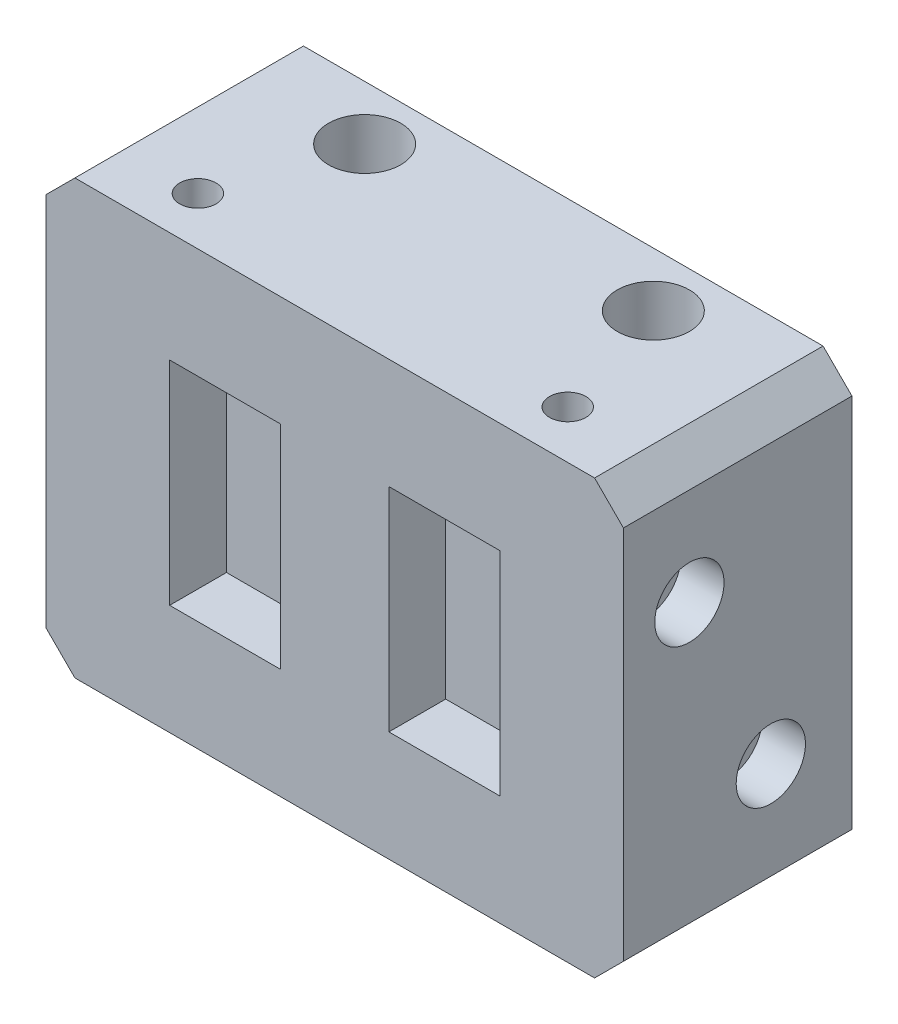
ISO-10303-21;
HEADER;
FILE_DESCRIPTION(('STEP AP214'),'2;1');
FILE_NAME('part.step','',(''),(''),'','','');
FILE_SCHEMA(('AUTOMOTIVE_DESIGN { 1 0 10303 214 1 1 1 1 }'));
ENDSEC;
DATA;
#1=APPLICATION_CONTEXT('core data for automotive mechanical design processes');
#2=APPLICATION_PROTOCOL_DEFINITION('international standard','automotive_design',2000,#1);
#3=PRODUCT_CONTEXT('',#1,'mechanical');
#4=PRODUCT('Part','Part','',(#3));
#5=PRODUCT_RELATED_PRODUCT_CATEGORY('part','',(#4));
#6=PRODUCT_DEFINITION_FORMATION('','',#4);
#7=PRODUCT_DEFINITION_CONTEXT('part definition',#1,'design');
#8=PRODUCT_DEFINITION('design','',#6,#7);
#9=PRODUCT_DEFINITION_SHAPE('','',#8);
#10=(LENGTH_UNIT() NAMED_UNIT(*) SI_UNIT(.MILLI.,.METRE.));
#11=(NAMED_UNIT(*) PLANE_ANGLE_UNIT() SI_UNIT($,.RADIAN.));
#12=(NAMED_UNIT(*) SI_UNIT($,.STERADIAN.) SOLID_ANGLE_UNIT());
#13=UNCERTAINTY_MEASURE_WITH_UNIT(LENGTH_MEASURE(1.E-05),#10,'distance_accuracy_value','');
#14=(GEOMETRIC_REPRESENTATION_CONTEXT(3) GLOBAL_UNCERTAINTY_ASSIGNED_CONTEXT((#13)) GLOBAL_UNIT_ASSIGNED_CONTEXT((#10,
#11,#12)) REPRESENTATION_CONTEXT('',''));
#15=CARTESIAN_POINT('',(0.,0.,0.));
#16=DIRECTION('',(0.,0.,1.));
#17=DIRECTION('',(1.,0.,0.));
#18=AXIS2_PLACEMENT_3D('',#15,#16,#17);
#19=CARTESIAN_POINT('',(30.95033,5.59999999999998,15.0725999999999));
#20=DIRECTION('',(0.,1.,0.));
#21=DIRECTION('',(0.,0.,1.));
#22=AXIS2_PLACEMENT_3D('',#19,#20,#21);
#23=PLANE('',#22);
#24=CARTESIAN_POINT('',(29.0974,5.59999999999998,15.0726));
#25=DIRECTION('',(0.,1.,0.));
#26=DIRECTION('',(0.,0.,1.));
#27=AXIS2_PLACEMENT_3D('',#24,#25,#26);
#28=CIRCLE('',#27,1.85293);
#29=CARTESIAN_POINT('',(29.0974,5.59999999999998,16.92553));
#30=VERTEX_POINT('',#29);
#31=EDGE_CURVE('E275',#30,#30,#28,.F.);
#32=ORIENTED_EDGE('',*,*,#31,.T.);
#33=EDGE_LOOP('',(#32));
#34=FACE_BOUND('',#33,.T.);
#35=ADVANCED_FACE('F32',(#34),#23,.F.);
#36=CARTESIAN_POINT('',(30.95033,5.59999999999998,4.17599999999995));
#37=DIRECTION('',(0.,1.,0.));
#38=DIRECTION('',(0.,0.,1.));
#39=AXIS2_PLACEMENT_3D('',#36,#37,#38);
#40=PLANE('',#39);
#41=CARTESIAN_POINT('',(29.0974,5.59999999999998,4.17599999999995));
#42=DIRECTION('',(0.,1.,0.));
#43=DIRECTION('',(0.,0.,1.));
#44=AXIS2_PLACEMENT_3D('',#41,#42,#43);
#45=CIRCLE('',#44,1.85293);
#46=CARTESIAN_POINT('',(29.0974,5.59999999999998,6.02892999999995));
#47=VERTEX_POINT('',#46);
#48=EDGE_CURVE('E273',#47,#47,#45,.F.);
#49=ORIENTED_EDGE('',*,*,#48,.T.);
#50=EDGE_LOOP('',(#49));
#51=FACE_BOUND('',#50,.T.);
#52=ADVANCED_FACE('F632',(#51),#40,.F.);
#53=CARTESIAN_POINT('',(43.55,26.5145909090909,13.9042));
#54=DIRECTION('',(-1.,0.,0.));
#55=DIRECTION('',(0.,0.,1.));
#56=AXIS2_PLACEMENT_3D('',#53,#54,#55);
#57=PLANE('',#56);
#58=CARTESIAN_POINT('',(43.55,26.2375,13.9042));
#59=DIRECTION('',(-1.,0.,0.));
#60=DIRECTION('',(0.,0.,1.));
#61=AXIS2_PLACEMENT_3D('',#58,#59,#60);
#62=CIRCLE('',#61,3.048);
#63=CARTESIAN_POINT('',(43.55,26.2375,16.9522));
#64=VERTEX_POINT('',#63);
#65=EDGE_CURVE('E270',#64,#64,#62,.F.);
#66=ORIENTED_EDGE('',*,*,#65,.T.);
#67=EDGE_LOOP('',(#66));
#68=FACE_BOUND('',#67,.T.);
#69=ADVANCED_FACE('F622',(#68),#57,.F.);
#70=CARTESIAN_POINT('',(43.55,10.6395909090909,6.74139999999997));
#71=DIRECTION('',(-1.,0.,0.));
#72=DIRECTION('',(0.,0.,1.));
#73=AXIS2_PLACEMENT_3D('',#70,#71,#72);
#74=PLANE('',#73);
#75=CARTESIAN_POINT('',(43.55,10.3625,6.74139999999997));
#76=DIRECTION('',(-1.,0.,0.));
#77=DIRECTION('',(0.,0.,1.));
#78=AXIS2_PLACEMENT_3D('',#75,#76,#77);
#79=CIRCLE('',#78,3.048);
#80=CARTESIAN_POINT('',(43.55,10.3625,9.78939999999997));
#81=VERTEX_POINT('',#80);
#82=EDGE_CURVE('E267',#81,#81,#79,.F.);
#83=ORIENTED_EDGE('',*,*,#82,.T.);
#84=EDGE_LOOP('',(#83));
#85=FACE_BOUND('',#84,.T.);
#86=ADVANCED_FACE('F612',(#85),#74,.F.);
#87=CARTESIAN_POINT('',(39.83144,31.,15.479));
#88=DIRECTION('',(0.,1.,0.));
#89=DIRECTION('',(0.,0.,1.));
#90=AXIS2_PLACEMENT_3D('',#87,#88,#89);
#91=PLANE('',#90);
#92=CARTESIAN_POINT('',(38.23124,31.,15.479));
#93=DIRECTION('',(0.,-1.,0.));
#94=DIRECTION('',(0.,0.,-1.));
#95=AXIS2_PLACEMENT_3D('',#92,#93,#94);
#96=CIRCLE('',#95,1.6002);
#97=CARTESIAN_POINT('',(38.23124,31.,13.8788));
#98=VERTEX_POINT('',#97);
#99=EDGE_CURVE('E264',#98,#98,#96,.F.);
#100=ORIENTED_EDGE('',*,*,#99,.T.);
#101=EDGE_LOOP('',(#100));
#102=FACE_BOUND('',#101,.T.);
#103=ADVANCED_FACE('F602',(#102),#91,.T.);
#104=CARTESIAN_POINT('',(12.435,31.,4.37919999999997));
#105=DIRECTION('',(0.,1.,0.));
#106=DIRECTION('',(0.,0.,1.));
#107=AXIS2_PLACEMENT_3D('',#104,#105,#106);
#108=PLANE('',#107);
#109=CARTESIAN_POINT('',(9.25999999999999,31.,4.37919999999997));
#110=DIRECTION('',(0.,-1.,0.));
#111=DIRECTION('',(0.,0.,-1.));
#112=AXIS2_PLACEMENT_3D('',#109,#110,#111);
#113=CIRCLE('',#112,3.175);
#114=CARTESIAN_POINT('',(9.25999999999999,31.,1.20419999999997));
#115=VERTEX_POINT('',#114);
#116=EDGE_CURVE('E261',#115,#115,#113,.F.);
#117=ORIENTED_EDGE('',*,*,#116,.T.);
#118=EDGE_LOOP('',(#117));
#119=FACE_BOUND('',#118,.T.);
#120=ADVANCED_FACE('F592',(#119),#108,.T.);
#121=CARTESIAN_POINT('',(7.28895999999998,31.,15.479));
#122=DIRECTION('',(0.,1.,0.));
#123=DIRECTION('',(0.,0.,1.));
#124=AXIS2_PLACEMENT_3D('',#121,#122,#123);
#125=PLANE('',#124);
#126=CARTESIAN_POINT('',(5.68875999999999,31.,15.479));
#127=DIRECTION('',(0.,-1.,0.));
#128=DIRECTION('',(1.,0.,0.));
#129=AXIS2_PLACEMENT_3D('',#126,#127,#128);
#130=CIRCLE('',#129,1.6002);
#131=CARTESIAN_POINT('',(7.28895999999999,31.,15.479));
#132=VERTEX_POINT('',#131);
#133=EDGE_CURVE('E258',#132,#132,#130,.F.);
#134=ORIENTED_EDGE('',*,*,#133,.T.);
#135=EDGE_LOOP('',(#134));
#136=FACE_BOUND('',#135,.T.);
#137=ADVANCED_FACE('F580',(#136),#125,.T.);
#138=CARTESIAN_POINT('',(37.835,31.,4.37919999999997));
#139=DIRECTION('',(0.,1.,0.));
#140=DIRECTION('',(0.,0.,1.));
#141=AXIS2_PLACEMENT_3D('',#138,#139,#140);
#142=PLANE('',#141);
#143=CARTESIAN_POINT('',(34.66,31.,4.37919999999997));
#144=DIRECTION('',(0.,-1.,0.));
#145=DIRECTION('',(0.,0.,-1.));
#146=AXIS2_PLACEMENT_3D('',#143,#144,#145);
#147=CIRCLE('',#146,3.175);
#148=CARTESIAN_POINT('',(34.66,31.,1.20419999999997));
#149=VERTEX_POINT('',#148);
#150=EDGE_CURVE('E255',#149,#149,#147,.F.);
#151=ORIENTED_EDGE('',*,*,#150,.T.);
#152=EDGE_LOOP('',(#151));
#153=FACE_BOUND('',#152,.T.);
#154=ADVANCED_FACE('F573',(#153),#142,.T.);
#155=CARTESIAN_POINT('',(29.0974,-0.750000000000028,15.0726));
#156=DIRECTION('',(0.,1.,0.));
#157=DIRECTION('',(0.,0.,1.));
#158=AXIS2_PLACEMENT_3D('',#155,#156,#157);
#159=CYLINDRICAL_SURFACE('',#158,1.85293);
#160=CARTESIAN_POINT('',(29.0974,-0.750000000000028,15.0726));
#161=DIRECTION('',(0.,1.,0.));
#162=DIRECTION('',(0.,0.,1.));
#163=AXIS2_PLACEMENT_3D('',#160,#161,#162);
#164=CIRCLE('',#163,1.85293);
#165=CARTESIAN_POINT('',(29.0974,-0.750000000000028,16.92553));
#166=VERTEX_POINT('',#165);
#167=EDGE_CURVE('E252',#166,#166,#164,.T.);
#168=ORIENTED_EDGE('',*,*,#167,.F.);
#169=EDGE_LOOP('',(#168));
#170=FACE_BOUND('',#169,.T.);
#171=ORIENTED_EDGE('',*,*,#31,.F.);
#172=EDGE_LOOP('',(#171));
#173=FACE_BOUND('',#172,.T.);
#174=ADVANCED_FACE('F579',(#170,#173),#159,.F.);
#175=CARTESIAN_POINT('',(29.0974,-0.750000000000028,4.17599999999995));
#176=DIRECTION('',(0.,1.,0.));
#177=DIRECTION('',(0.,0.,1.));
#178=AXIS2_PLACEMENT_3D('',#175,#176,#177);
#179=CYLINDRICAL_SURFACE('',#178,1.85293);
#180=CARTESIAN_POINT('',(29.0974,-0.750000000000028,4.17599999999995));
#181=DIRECTION('',(0.,1.,0.));
#182=DIRECTION('',(0.,0.,1.));
#183=AXIS2_PLACEMENT_3D('',#180,#181,#182);
#184=CIRCLE('',#183,1.85293);
#185=CARTESIAN_POINT('',(29.0974,-0.750000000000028,6.02892999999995));
#186=VERTEX_POINT('',#185);
#187=EDGE_CURVE('E248',#186,#186,#184,.T.);
#188=ORIENTED_EDGE('',*,*,#187,.F.);
#189=EDGE_LOOP('',(#188));
#190=FACE_BOUND('',#189,.T.);
#191=ORIENTED_EDGE('',*,*,#48,.F.);
#192=EDGE_LOOP('',(#191));
#193=FACE_BOUND('',#192,.T.);
#194=ADVANCED_FACE('F770',(#190,#193),#179,.F.);
#195=CARTESIAN_POINT('',(47.36,26.2375,13.9042));
#196=DIRECTION('',(-1.,0.,0.));
#197=DIRECTION('',(0.,0.,1.));
#198=AXIS2_PLACEMENT_3D('',#195,#196,#197);
#199=CYLINDRICAL_SURFACE('',#198,3.048);
#200=CARTESIAN_POINT('',(47.36,26.2375,13.9042));
#201=DIRECTION('',(-1.,0.,0.));
#202=DIRECTION('',(0.,0.,1.));
#203=AXIS2_PLACEMENT_3D('',#200,#201,#202);
#204=CIRCLE('',#203,3.048);
#205=CARTESIAN_POINT('',(47.36,26.2375,16.9522));
#206=VERTEX_POINT('',#205);
#207=EDGE_CURVE('E244',#206,#206,#204,.T.);
#208=ORIENTED_EDGE('',*,*,#207,.F.);
#209=EDGE_LOOP('',(#208));
#210=FACE_BOUND('',#209,.T.);
#211=ORIENTED_EDGE('',*,*,#65,.F.);
#212=EDGE_LOOP('',(#211));
#213=FACE_BOUND('',#212,.T.);
#214=ADVANCED_FACE('F762',(#210,#213),#199,.F.);
#215=CARTESIAN_POINT('',(47.36,10.3625,6.74139999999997));
#216=DIRECTION('',(-1.,0.,0.));
#217=DIRECTION('',(0.,0.,1.));
#218=AXIS2_PLACEMENT_3D('',#215,#216,#217);
#219=CYLINDRICAL_SURFACE('',#218,3.048);
#220=CARTESIAN_POINT('',(47.36,10.3625,6.74139999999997));
#221=DIRECTION('',(-1.,0.,0.));
#222=DIRECTION('',(0.,0.,1.));
#223=AXIS2_PLACEMENT_3D('',#220,#221,#222);
#224=CIRCLE('',#223,3.048);
#225=CARTESIAN_POINT('',(47.36,10.3625,9.78939999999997));
#226=VERTEX_POINT('',#225);
#227=EDGE_CURVE('E240',#226,#226,#224,.T.);
#228=ORIENTED_EDGE('',*,*,#227,.F.);
#229=EDGE_LOOP('',(#228));
#230=FACE_BOUND('',#229,.T.);
#231=ORIENTED_EDGE('',*,*,#82,.F.);
#232=EDGE_LOOP('',(#231));
#233=FACE_BOUND('',#232,.T.);
#234=ADVANCED_FACE('F753',(#230,#233),#219,.F.);
#235=CARTESIAN_POINT('',(38.23124,37.35,15.479));
#236=DIRECTION('',(0.,-1.,0.));
#237=DIRECTION('',(0.,0.,-1.));
#238=AXIS2_PLACEMENT_3D('',#235,#236,#237);
#239=CYLINDRICAL_SURFACE('',#238,1.6002);
#240=CARTESIAN_POINT('',(38.23124,37.35,15.479));
#241=DIRECTION('',(0.,-1.,0.));
#242=DIRECTION('',(0.,0.,-1.));
#243=AXIS2_PLACEMENT_3D('',#240,#241,#242);
#244=CIRCLE('',#243,1.6002);
#245=CARTESIAN_POINT('',(38.23124,37.35,13.8788));
#246=VERTEX_POINT('',#245);
#247=EDGE_CURVE('E236',#246,#246,#244,.T.);
#248=ORIENTED_EDGE('',*,*,#247,.F.);
#249=EDGE_LOOP('',(#248));
#250=FACE_BOUND('',#249,.T.);
#251=ORIENTED_EDGE('',*,*,#99,.F.);
#252=EDGE_LOOP('',(#251));
#253=FACE_BOUND('',#252,.T.);
#254=ADVANCED_FACE('F743',(#250,#253),#239,.F.);
#255=CARTESIAN_POINT('',(9.25999999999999,37.3499999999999,4.37919999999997));
#256=DIRECTION('',(0.,-1.,0.));
#257=DIRECTION('',(0.,0.,-1.));
#258=AXIS2_PLACEMENT_3D('',#255,#256,#257);
#259=CYLINDRICAL_SURFACE('',#258,3.175);
#260=CARTESIAN_POINT('',(9.25999999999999,37.3499999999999,4.37919999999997));
#261=DIRECTION('',(0.,-1.,0.));
#262=DIRECTION('',(0.,0.,-1.));
#263=AXIS2_PLACEMENT_3D('',#260,#261,#262);
#264=CIRCLE('',#263,3.175);
#265=CARTESIAN_POINT('',(9.25999999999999,37.3499999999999,1.20419999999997));
#266=VERTEX_POINT('',#265);
#267=EDGE_CURVE('E233',#266,#266,#264,.T.);
#268=ORIENTED_EDGE('',*,*,#267,.F.);
#269=EDGE_LOOP('',(#268));
#270=FACE_BOUND('',#269,.T.);
#271=ORIENTED_EDGE('',*,*,#116,.F.);
#272=EDGE_LOOP('',(#271));
#273=FACE_BOUND('',#272,.T.);
#274=ADVANCED_FACE('F733',(#270,#273),#259,.F.);
#275=CARTESIAN_POINT('',(5.68875999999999,37.35,15.479));
#276=DIRECTION('',(0.,-1.,0.));
#277=DIRECTION('',(1.,0.,0.));
#278=AXIS2_PLACEMENT_3D('',#275,#276,#277);
#279=CYLINDRICAL_SURFACE('',#278,1.6002);
#280=CARTESIAN_POINT('',(5.68875999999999,37.35,15.479));
#281=DIRECTION('',(0.,-1.,0.));
#282=DIRECTION('',(1.,0.,0.));
#283=AXIS2_PLACEMENT_3D('',#280,#281,#282);
#284=CIRCLE('',#283,1.6002);
#285=CARTESIAN_POINT('',(7.28895999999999,37.35,15.479));
#286=VERTEX_POINT('',#285);
#287=EDGE_CURVE('E230',#286,#286,#284,.T.);
#288=ORIENTED_EDGE('',*,*,#287,.F.);
#289=EDGE_LOOP('',(#288));
#290=FACE_BOUND('',#289,.T.);
#291=ORIENTED_EDGE('',*,*,#133,.F.);
#292=EDGE_LOOP('',(#291));
#293=FACE_BOUND('',#292,.T.);
#294=ADVANCED_FACE('F723',(#290,#293),#279,.F.);
#295=CARTESIAN_POINT('',(34.66,37.3499999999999,4.37919999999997));
#296=DIRECTION('',(0.,-1.,0.));
#297=DIRECTION('',(0.,0.,-1.));
#298=AXIS2_PLACEMENT_3D('',#295,#296,#297);
#299=CYLINDRICAL_SURFACE('',#298,3.175);
#300=CARTESIAN_POINT('',(34.66,37.3499999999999,4.37919999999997));
#301=DIRECTION('',(0.,-1.,0.));
#302=DIRECTION('',(0.,0.,-1.));
#303=AXIS2_PLACEMENT_3D('',#300,#301,#302);
#304=CIRCLE('',#303,3.175);
#305=CARTESIAN_POINT('',(34.66,37.3499999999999,1.20419999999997));
#306=VERTEX_POINT('',#305);
#307=EDGE_CURVE('E172',#306,#306,#304,.T.);
#308=ORIENTED_EDGE('',*,*,#307,.F.);
#309=EDGE_LOOP('',(#308));
#310=FACE_BOUND('',#309,.T.);
#311=ORIENTED_EDGE('',*,*,#150,.F.);
#312=EDGE_LOOP('',(#311));
#313=FACE_BOUND('',#312,.T.);
#314=ADVANCED_FACE('F713',(#310,#313),#299,.F.);
#315=CARTESIAN_POINT('',(20.8054545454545,18.3,2.14399999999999));
#316=DIRECTION('',(0.,0.,-1.));
#317=DIRECTION('',(-1.,0.,0.));
#318=AXIS2_PLACEMENT_3D('',#315,#316,#317);
#319=PLANE('',#318);
#320=CARTESIAN_POINT('',(21.96,18.3,2.14399999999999));
#321=DIRECTION('',(0.,0.,1.));
#322=DIRECTION('',(1.,0.,0.));
#323=AXIS2_PLACEMENT_3D('',#320,#321,#322);
#324=CIRCLE('',#323,12.7);
#325=CARTESIAN_POINT('',(34.66,18.3,2.14399999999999));
#326=VERTEX_POINT('',#325);
#327=EDGE_CURVE('E177',#326,#326,#324,.F.);
#328=ORIENTED_EDGE('',*,*,#327,.T.);
#329=EDGE_LOOP('',(#328));
#330=FACE_BOUND('',#329,.T.);
#331=ADVANCED_FACE('F703',(#330),#319,.T.);
#332=CARTESIAN_POINT('',(0.507159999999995,5.59999999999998,5.95399999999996));
#333=DIRECTION('',(0.,0.,-1.));
#334=DIRECTION('',(-1.,0.,0.));
#335=AXIS2_PLACEMENT_3D('',#332,#333,#334);
#336=PLANE('',#335);
#337=CARTESIAN_POINT('',(2.90999999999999,5.59999999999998,5.95399999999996));
#338=DIRECTION('',(0.,0.,1.));
#339=DIRECTION('',(0.,-1.,0.));
#340=AXIS2_PLACEMENT_3D('',#337,#338,#339);
#341=CIRCLE('',#340,2.40284);
#342=CARTESIAN_POINT('',(2.90999999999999,3.19715999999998,5.95399999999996));
#343=VERTEX_POINT('',#342);
#344=EDGE_CURVE('E223',#343,#343,#341,.F.);
#345=ORIENTED_EDGE('',*,*,#344,.T.);
#346=EDGE_LOOP('',(#345));
#347=FACE_BOUND('',#346,.T.);
#348=ADVANCED_FACE('F463',(#347),#336,.T.);
#349=CARTESIAN_POINT('',(38.60716,31.,5.95399999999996));
#350=DIRECTION('',(0.,0.,-1.));
#351=DIRECTION('',(-1.,0.,0.));
#352=AXIS2_PLACEMENT_3D('',#349,#350,#351);
#353=PLANE('',#352);
#354=CARTESIAN_POINT('',(41.01,31.,5.95399999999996));
#355=DIRECTION('',(0.,0.,1.));
#356=DIRECTION('',(1.,0.,0.));
#357=AXIS2_PLACEMENT_3D('',#354,#355,#356);
#358=CIRCLE('',#357,2.40284);
#359=CARTESIAN_POINT('',(43.41284,31.,5.95399999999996));
#360=VERTEX_POINT('',#359);
#361=EDGE_CURVE('E220',#360,#360,#358,.F.);
#362=ORIENTED_EDGE('',*,*,#361,.T.);
#363=EDGE_LOOP('',(#362));
#364=FACE_BOUND('',#363,.T.);
#365=ADVANCED_FACE('F456',(#364),#353,.T.);
#366=CARTESIAN_POINT('',(37.835,18.2999999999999,12.304));
#367=DIRECTION('',(0.,0.,-1.));
#368=DIRECTION('',(-1.,0.,0.));
#369=AXIS2_PLACEMENT_3D('',#366,#367,#368);
#370=PLANE('',#369);
#371=CARTESIAN_POINT('',(41.01,18.3,12.304));
#372=DIRECTION('',(0.,0.,1.));
#373=DIRECTION('',(1.,0.,0.));
#374=AXIS2_PLACEMENT_3D('',#371,#372,#373);
#375=CIRCLE('',#374,3.175);
#376=CARTESIAN_POINT('',(44.185,18.3,12.304));
#377=VERTEX_POINT('',#376);
#378=EDGE_CURVE('E201',#377,#377,#375,.F.);
#379=ORIENTED_EDGE('',*,*,#378,.T.);
#380=EDGE_LOOP('',(#379));
#381=FACE_BOUND('',#380,.T.);
#382=ADVANCED_FACE('F454',(#381),#370,.T.);
#383=CARTESIAN_POINT('',(-0.900000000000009,-0.750000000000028,35.2147999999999));
#384=DIRECTION('',(0.,-1.,0.));
#385=DIRECTION('',(0.,0.,-1.));
#386=AXIS2_PLACEMENT_3D('',#383,#384,#385);
#387=PLANE('',#386);
#388=DIRECTION('',(1.,0.,0.));
#389=VECTOR('',#388,1.);
#390=CARTESIAN_POINT('',(-3.44,-0.750000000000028,19.7081));
#391=LINE('',#390,#389);
#392=CARTESIAN_POINT('',(-0.899999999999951,-0.750000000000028,19.7081));
#393=VERTEX_POINT('',#392);
#394=CARTESIAN_POINT('',(44.82,-0.750000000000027,19.7081));
#395=VERTEX_POINT('',#394);
#396=EDGE_CURVE('E162',#393,#395,#391,.T.);
#397=ORIENTED_EDGE('',*,*,#396,.F.);
#398=DIRECTION('',(0.,0.,1.));
#399=VECTOR('',#398,1.);
#400=CARTESIAN_POINT('',(-0.899999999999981,-0.75,35.2148));
#401=LINE('',#400,#399);
#402=CARTESIAN_POINT('',(-0.900000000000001,-0.750000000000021,-0.396000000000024));
#403=VERTEX_POINT('',#402);
#404=EDGE_CURVE('E170',#403,#393,#401,.T.);
#405=ORIENTED_EDGE('',*,*,#404,.F.);
#406=DIRECTION('',(1.,0.,0.));
#407=VECTOR('',#406,1.);
#408=CARTESIAN_POINT('',(-3.44000000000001,-0.750000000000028,-0.396000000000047));
#409=LINE('',#408,#407);
#410=CARTESIAN_POINT('',(44.82,-0.750000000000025,-0.396000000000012));
#411=VERTEX_POINT('',#410);
#412=EDGE_CURVE('E198',#403,#411,#409,.T.);
#413=ORIENTED_EDGE('',*,*,#412,.T.);
#414=DIRECTION('',(0.,0.,1.));
#415=VECTOR('',#414,1.);
#416=CARTESIAN_POINT('',(44.82,-0.750000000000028,35.2147999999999));
#417=LINE('',#416,#415);
#418=EDGE_CURVE('E251',#395,#411,#417,.F.);
#419=ORIENTED_EDGE('',*,*,#418,.F.);
#420=EDGE_LOOP('',(#397,#405,#413,#419));
#421=FACE_BOUND('',#420,.T.);
#422=ORIENTED_EDGE('',*,*,#187,.T.);
#423=EDGE_LOOP('',(#422));
#424=FACE_BOUND('',#423,.T.);
#425=ORIENTED_EDGE('',*,*,#167,.T.);
#426=EDGE_LOOP('',(#425));
#427=FACE_BOUND('',#426,.T.);
#428=ADVANCED_FACE('F322',(#421,#424,#427),#387,.T.);
#429=CARTESIAN_POINT('',(44.82,-0.750000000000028,35.2147999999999));
#430=DIRECTION('',(0.707106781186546,-0.707106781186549,0.));
#431=DIRECTION('',(0.707106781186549,0.707106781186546,0.));
#432=AXIS2_PLACEMENT_3D('',#429,#430,#431);
#433=PLANE('',#432);
#434=DIRECTION('',(0.707106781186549,0.707106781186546,0.));
#435=VECTOR('',#434,1.);
#436=CARTESIAN_POINT('',(44.82,-0.750000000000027,19.7081));
#437=LINE('',#436,#435);
#438=CARTESIAN_POINT('',(47.36,1.78999999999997,19.7081));
#439=VERTEX_POINT('',#438);
#440=EDGE_CURVE('E319',#395,#439,#437,.T.);
#441=ORIENTED_EDGE('',*,*,#440,.F.);
#442=ORIENTED_EDGE('',*,*,#418,.T.);
#443=DIRECTION('',(0.70710678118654,0.707106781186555,0.));
#444=VECTOR('',#443,1.);
#445=CARTESIAN_POINT('',(44.82,-0.750000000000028,-0.396000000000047));
#446=LINE('',#445,#444);
#447=CARTESIAN_POINT('',(47.36,1.78999999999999,-0.396000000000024));
#448=VERTEX_POINT('',#447);
#449=EDGE_CURVE('E195',#411,#448,#446,.T.);
#450=ORIENTED_EDGE('',*,*,#449,.T.);
#451=DIRECTION('',(0.,0.,-1.));
#452=VECTOR('',#451,1.);
#453=CARTESIAN_POINT('',(47.36,1.78999999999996,35.2148));
#454=LINE('',#453,#452);
#455=EDGE_CURVE('E247',#439,#448,#454,.T.);
#456=ORIENTED_EDGE('',*,*,#455,.F.);
#457=EDGE_LOOP('',(#441,#442,#450,#456));
#458=FACE_BOUND('',#457,.T.);
#459=ADVANCED_FACE('F317',(#458),#433,.T.);
#460=CARTESIAN_POINT('',(47.36,1.79000000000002,35.2148));
#461=DIRECTION('',(1.,0.,0.));
#462=DIRECTION('',(0.,0.,-1.));
#463=AXIS2_PLACEMENT_3D('',#460,#461,#462);
#464=PLANE('',#463);
#465=DIRECTION('',(0.,1.,0.));
#466=VECTOR('',#465,1.);
#467=CARTESIAN_POINT('',(47.36,-0.750000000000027,19.7081));
#468=LINE('',#467,#466);
#469=CARTESIAN_POINT('',(47.36,34.81,19.7081));
#470=VERTEX_POINT('',#469);
#471=EDGE_CURVE('E312',#439,#470,#468,.T.);
#472=ORIENTED_EDGE('',*,*,#471,.F.);
#473=ORIENTED_EDGE('',*,*,#455,.T.);
#474=DIRECTION('',(0.,1.,0.));
#475=VECTOR('',#474,1.);
#476=CARTESIAN_POINT('',(47.36,1.79000000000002,-0.396000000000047));
#477=LINE('',#476,#475);
#478=CARTESIAN_POINT('',(47.36,34.81,-0.396000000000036));
#479=VERTEX_POINT('',#478);
#480=EDGE_CURVE('E192',#448,#479,#477,.T.);
#481=ORIENTED_EDGE('',*,*,#480,.T.);
#482=DIRECTION('',(0.,0.,1.));
#483=VECTOR('',#482,1.);
#484=CARTESIAN_POINT('',(47.36,34.81,35.2147999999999));
#485=LINE('',#484,#483);
#486=EDGE_CURVE('E243',#470,#479,#485,.F.);
#487=ORIENTED_EDGE('',*,*,#486,.F.);
#488=EDGE_LOOP('',(#472,#473,#481,#487));
#489=FACE_BOUND('',#488,.T.);
#490=ORIENTED_EDGE('',*,*,#227,.T.);
#491=EDGE_LOOP('',(#490));
#492=FACE_BOUND('',#491,.T.);
#493=ORIENTED_EDGE('',*,*,#207,.T.);
#494=EDGE_LOOP('',(#493));
#495=FACE_BOUND('',#494,.T.);
#496=ADVANCED_FACE('F310',(#489,#492,#495),#464,.T.);
#497=CARTESIAN_POINT('',(47.36,34.81,35.2147999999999));
#498=DIRECTION('',(0.707106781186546,0.707106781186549,0.));
#499=DIRECTION('',(-0.707106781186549,0.707106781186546,0.));
#500=AXIS2_PLACEMENT_3D('',#497,#498,#499);
#501=PLANE('',#500);
#502=DIRECTION('',(-0.707106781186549,0.707106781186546,0.));
#503=VECTOR('',#502,1.);
#504=CARTESIAN_POINT('',(47.36,34.81,19.7081));
#505=LINE('',#504,#503);
#506=CARTESIAN_POINT('',(44.82,37.35,19.7081));
#507=VERTEX_POINT('',#506);
#508=EDGE_CURVE('E153',#470,#507,#505,.T.);
#509=ORIENTED_EDGE('',*,*,#508,.F.);
#510=ORIENTED_EDGE('',*,*,#486,.T.);
#511=DIRECTION('',(-0.707106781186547,0.707106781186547,0.));
#512=VECTOR('',#511,1.);
#513=CARTESIAN_POINT('',(47.36,34.81,-0.396000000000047));
#514=LINE('',#513,#512);
#515=CARTESIAN_POINT('',(44.82,37.35,-0.396000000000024));
#516=VERTEX_POINT('',#515);
#517=EDGE_CURVE('E189',#479,#516,#514,.T.);
#518=ORIENTED_EDGE('',*,*,#517,.T.);
#519=DIRECTION('',(0.,0.,1.));
#520=VECTOR('',#519,1.);
#521=CARTESIAN_POINT('',(44.82,37.35,35.2148));
#522=LINE('',#521,#520);
#523=EDGE_CURVE('E239',#507,#516,#522,.F.);
#524=ORIENTED_EDGE('',*,*,#523,.F.);
#525=EDGE_LOOP('',(#509,#510,#518,#524));
#526=FACE_BOUND('',#525,.T.);
#527=ADVANCED_FACE('F306',(#526),#501,.T.);
#528=CARTESIAN_POINT('',(44.82,37.35,35.2148));
#529=DIRECTION('',(0.,1.,0.));
#530=DIRECTION('',(0.,0.,1.));
#531=AXIS2_PLACEMENT_3D('',#528,#529,#530);
#532=PLANE('',#531);
#533=DIRECTION('',(-1.,0.,0.));
#534=VECTOR('',#533,1.);
#535=CARTESIAN_POINT('',(47.36,37.35,19.7081));
#536=LINE('',#535,#534);
#537=CARTESIAN_POINT('',(-0.900000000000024,37.35,19.7081));
#538=VERTEX_POINT('',#537);
#539=EDGE_CURVE('E149',#507,#538,#536,.T.);
#540=ORIENTED_EDGE('',*,*,#539,.F.);
#541=ORIENTED_EDGE('',*,*,#523,.T.);
#542=DIRECTION('',(1.,0.,0.));
#543=VECTOR('',#542,1.);
#544=CARTESIAN_POINT('',(-3.44000000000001,37.35,-0.396000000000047));
#545=LINE('',#544,#543);
#546=CARTESIAN_POINT('',(-0.900000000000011,37.35,-0.396000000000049));
#547=VERTEX_POINT('',#546);
#548=EDGE_CURVE('E186',#516,#547,#545,.F.);
#549=ORIENTED_EDGE('',*,*,#548,.T.);
#550=DIRECTION('',(0.,0.,1.));
#551=VECTOR('',#550,1.);
#552=CARTESIAN_POINT('',(-0.90000000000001,37.35,35.2148));
#553=LINE('',#552,#551);
#554=EDGE_CURVE('E168',#538,#547,#553,.F.);
#555=ORIENTED_EDGE('',*,*,#554,.F.);
#556=EDGE_LOOP('',(#540,#541,#549,#555));
#557=FACE_BOUND('',#556,.T.);
#558=ORIENTED_EDGE('',*,*,#307,.T.);
#559=EDGE_LOOP('',(#558));
#560=FACE_BOUND('',#559,.T.);
#561=ORIENTED_EDGE('',*,*,#287,.T.);
#562=EDGE_LOOP('',(#561));
#563=FACE_BOUND('',#562,.T.);
#564=ORIENTED_EDGE('',*,*,#267,.T.);
#565=EDGE_LOOP('',(#564));
#566=FACE_BOUND('',#565,.T.);
#567=ORIENTED_EDGE('',*,*,#247,.T.);
#568=EDGE_LOOP('',(#567));
#569=FACE_BOUND('',#568,.T.);
#570=ADVANCED_FACE('F298',(#557,#560,#563,#566,#569),#532,.T.);
#571=CARTESIAN_POINT('',(-0.900000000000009,37.35,35.2148));
#572=DIRECTION('',(-0.707106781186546,0.707106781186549,0.));
#573=DIRECTION('',(-0.707106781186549,-0.707106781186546,0.));
#574=AXIS2_PLACEMENT_3D('',#571,#572,#573);
#575=PLANE('',#574);
#576=DIRECTION('',(-0.707106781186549,-0.707106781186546,0.));
#577=VECTOR('',#576,1.);
#578=CARTESIAN_POINT('',(-0.90000000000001,37.35,19.7081));
#579=LINE('',#578,#577);
#580=CARTESIAN_POINT('',(-3.44,34.81,19.7081));
#581=VERTEX_POINT('',#580);
#582=EDGE_CURVE('E143',#538,#581,#579,.T.);
#583=ORIENTED_EDGE('',*,*,#582,.F.);
#584=ORIENTED_EDGE('',*,*,#554,.T.);
#585=DIRECTION('',(-0.707106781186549,-0.707106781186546,0.));
#586=VECTOR('',#585,1.);
#587=CARTESIAN_POINT('',(-0.900000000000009,37.35,-0.396000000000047));
#588=LINE('',#587,#586);
#589=CARTESIAN_POINT('',(-3.44000000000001,34.81,-0.396000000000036));
#590=VERTEX_POINT('',#589);
#591=EDGE_CURVE('E167',#547,#590,#588,.T.);
#592=ORIENTED_EDGE('',*,*,#591,.T.);
#593=DIRECTION('',(0.,0.,1.));
#594=VECTOR('',#593,1.);
#595=CARTESIAN_POINT('',(-3.44000000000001,34.8099999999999,35.2147999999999));
#596=LINE('',#595,#594);
#597=EDGE_CURVE('E159',#581,#590,#596,.F.);
#598=ORIENTED_EDGE('',*,*,#597,.F.);
#599=EDGE_LOOP('',(#583,#584,#592,#598));
#600=FACE_BOUND('',#599,.T.);
#601=ADVANCED_FACE('F165',(#600),#575,.T.);
#602=CARTESIAN_POINT('',(-3.44000000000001,34.81,35.2147999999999));
#603=DIRECTION('',(-1.,0.,0.));
#604=DIRECTION('',(0.,0.,1.));
#605=AXIS2_PLACEMENT_3D('',#602,#603,#604);
#606=PLANE('',#605);
#607=DIRECTION('',(0.,-1.,0.));
#608=VECTOR('',#607,1.);
#609=CARTESIAN_POINT('',(-3.44,37.35,19.7081));
#610=LINE('',#609,#608);
#611=CARTESIAN_POINT('',(-3.43999999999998,1.78999999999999,19.7081));
#612=VERTEX_POINT('',#611);
#613=EDGE_CURVE('E146',#581,#612,#610,.T.);
#614=ORIENTED_EDGE('',*,*,#613,.F.);
#615=ORIENTED_EDGE('',*,*,#597,.T.);
#616=DIRECTION('',(0.,1.,0.));
#617=VECTOR('',#616,1.);
#618=CARTESIAN_POINT('',(-3.44000000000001,1.79000000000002,-0.396000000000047));
#619=LINE('',#618,#617);
#620=CARTESIAN_POINT('',(-3.44,1.79000000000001,-0.396000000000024));
#621=VERTEX_POINT('',#620);
#622=EDGE_CURVE('E183',#590,#621,#619,.F.);
#623=ORIENTED_EDGE('',*,*,#622,.T.);
#624=DIRECTION('',(0.,0.,1.));
#625=VECTOR('',#624,1.);
#626=CARTESIAN_POINT('',(-3.43999999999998,1.78999999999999,35.2148));
#627=LINE('',#626,#625);
#628=EDGE_CURVE('E161',#612,#621,#627,.F.);
#629=ORIENTED_EDGE('',*,*,#628,.F.);
#630=EDGE_LOOP('',(#614,#615,#623,#629));
#631=FACE_BOUND('',#630,.T.);
#632=ADVANCED_FACE('F157',(#631),#606,.T.);
#633=CARTESIAN_POINT('',(-3.44000000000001,1.79000000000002,35.2148));
#634=DIRECTION('',(-0.707106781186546,-0.707106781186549,0.));
#635=DIRECTION('',(0.707106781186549,-0.707106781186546,0.));
#636=AXIS2_PLACEMENT_3D('',#633,#634,#635);
#637=PLANE('',#636);
#638=DIRECTION('',(0.707106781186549,-0.707106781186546,0.));
#639=VECTOR('',#638,1.);
#640=CARTESIAN_POINT('',(-3.44000000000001,1.79000000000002,19.7081));
#641=LINE('',#640,#639);
#642=EDGE_CURVE('E11',#612,#393,#641,.T.);
#643=ORIENTED_EDGE('',*,*,#642,.F.);
#644=ORIENTED_EDGE('',*,*,#628,.T.);
#645=DIRECTION('',(0.707106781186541,-0.707106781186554,0.));
#646=VECTOR('',#645,1.);
#647=CARTESIAN_POINT('',(-3.44000000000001,1.79000000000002,-0.396000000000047));
#648=LINE('',#647,#646);
#649=EDGE_CURVE('E179',#621,#403,#648,.T.);
#650=ORIENTED_EDGE('',*,*,#649,.T.);
#651=ORIENTED_EDGE('',*,*,#404,.T.);
#652=EDGE_LOOP('',(#643,#644,#650,#651));
#653=FACE_BOUND('',#652,.T.);
#654=ADVANCED_FACE('F327',(#653),#637,.T.);
#655=CARTESIAN_POINT('',(21.96,18.3,-0.396000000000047));
#656=DIRECTION('',(0.,0.,1.));
#657=DIRECTION('',(1.,0.,0.));
#658=AXIS2_PLACEMENT_3D('',#655,#656,#657);
#659=CYLINDRICAL_SURFACE('',#658,12.7);
#660=ORIENTED_EDGE('',*,*,#327,.F.);
#661=EDGE_LOOP('',(#660));
#662=FACE_BOUND('',#661,.T.);
#663=CARTESIAN_POINT('',(21.96,18.3,-0.396000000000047));
#664=DIRECTION('',(0.,0.,1.));
#665=DIRECTION('',(1.,0.,0.));
#666=AXIS2_PLACEMENT_3D('',#663,#664,#665);
#667=CIRCLE('',#666,12.7);
#668=CARTESIAN_POINT('',(34.66,18.3,-0.396000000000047));
#669=VERTEX_POINT('',#668);
#670=EDGE_CURVE('E182',#669,#669,#667,.F.);
#671=ORIENTED_EDGE('',*,*,#670,.T.);
#672=EDGE_LOOP('',(#671));
#673=FACE_BOUND('',#672,.T.);
#674=ADVANCED_FACE('F428',(#662,#673),#659,.F.);
#675=CARTESIAN_POINT('',(2.90999999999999,5.59999999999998,-0.396000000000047));
#676=DIRECTION('',(0.,0.,1.));
#677=DIRECTION('',(0.,-1.,0.));
#678=AXIS2_PLACEMENT_3D('',#675,#676,#677);
#679=CYLINDRICAL_SURFACE('',#678,2.40284);
#680=ORIENTED_EDGE('',*,*,#344,.F.);
#681=EDGE_LOOP('',(#680));
#682=FACE_BOUND('',#681,.T.);
#683=CARTESIAN_POINT('',(2.90999999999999,5.59999999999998,-0.396000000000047));
#684=DIRECTION('',(0.,0.,1.));
#685=DIRECTION('',(0.,-1.,0.));
#686=AXIS2_PLACEMENT_3D('',#683,#684,#685);
#687=CIRCLE('',#686,2.40284);
#688=CARTESIAN_POINT('',(2.90999999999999,3.19715999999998,-0.396000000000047));
#689=VERTEX_POINT('',#688);
#690=EDGE_CURVE('E213',#689,#689,#687,.F.);
#691=ORIENTED_EDGE('',*,*,#690,.T.);
#692=EDGE_LOOP('',(#691));
#693=FACE_BOUND('',#692,.T.);
#694=ADVANCED_FACE('F430',(#682,#693),#679,.F.);
#695=CARTESIAN_POINT('',(41.01,31.,-0.396000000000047));
#696=DIRECTION('',(0.,0.,1.));
#697=DIRECTION('',(1.,0.,0.));
#698=AXIS2_PLACEMENT_3D('',#695,#696,#697);
#699=CYLINDRICAL_SURFACE('',#698,2.40284);
#700=ORIENTED_EDGE('',*,*,#361,.F.);
#701=EDGE_LOOP('',(#700));
#702=FACE_BOUND('',#701,.T.);
#703=CARTESIAN_POINT('',(41.01,31.,-0.396000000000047));
#704=DIRECTION('',(0.,0.,1.));
#705=DIRECTION('',(1.,0.,0.));
#706=AXIS2_PLACEMENT_3D('',#703,#704,#705);
#707=CIRCLE('',#706,2.40284);
#708=CARTESIAN_POINT('',(43.41284,31.,-0.396000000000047));
#709=VERTEX_POINT('',#708);
#710=EDGE_CURVE('E210',#709,#709,#707,.F.);
#711=ORIENTED_EDGE('',*,*,#710,.T.);
#712=EDGE_LOOP('',(#711));
#713=FACE_BOUND('',#712,.T.);
#714=ADVANCED_FACE('F437',(#702,#713),#699,.F.);
#715=CARTESIAN_POINT('',(41.01,18.3,-0.396000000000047));
#716=DIRECTION('',(0.,0.,1.));
#717=DIRECTION('',(1.,0.,0.));
#718=AXIS2_PLACEMENT_3D('',#715,#716,#717);
#719=CYLINDRICAL_SURFACE('',#718,3.175);
#720=ORIENTED_EDGE('',*,*,#378,.F.);
#721=EDGE_LOOP('',(#720));
#722=FACE_BOUND('',#721,.T.);
#723=CARTESIAN_POINT('',(41.01,18.3,-0.396000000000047));
#724=DIRECTION('',(0.,0.,1.));
#725=DIRECTION('',(1.,0.,0.));
#726=AXIS2_PLACEMENT_3D('',#723,#724,#725);
#727=CIRCLE('',#726,3.175);
#728=CARTESIAN_POINT('',(44.185,18.3,-0.396000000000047));
#729=VERTEX_POINT('',#728);
#730=EDGE_CURVE('E207',#729,#729,#727,.F.);
#731=ORIENTED_EDGE('',*,*,#730,.T.);
#732=EDGE_LOOP('',(#731));
#733=FACE_BOUND('',#732,.T.);
#734=ADVANCED_FACE('F418',(#722,#733),#719,.F.);
#735=CARTESIAN_POINT('',(-3.44000000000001,1.79000000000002,-0.396000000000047));
#736=DIRECTION('',(0.,0.,1.));
#737=DIRECTION('',(1.,0.,0.));
#738=AXIS2_PLACEMENT_3D('',#735,#736,#737);
#739=PLANE('',#738);
#740=CARTESIAN_POINT('',(2.90999999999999,18.3,-0.396000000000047));
#741=DIRECTION('',(0.,0.,1.));
#742=DIRECTION('',(1.,0.,0.));
#743=AXIS2_PLACEMENT_3D('',#740,#741,#742);
#744=CIRCLE('',#743,3.175);
#745=CARTESIAN_POINT('',(6.08499999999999,18.3,-0.396000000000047));
#746=VERTEX_POINT('',#745);
#747=EDGE_CURVE('E204',#746,#746,#744,.T.);
#748=ORIENTED_EDGE('',*,*,#747,.T.);
#749=EDGE_LOOP('',(#748));
#750=FACE_BOUND('',#749,.T.);
#751=ORIENTED_EDGE('',*,*,#730,.F.);
#752=EDGE_LOOP('',(#751));
#753=FACE_BOUND('',#752,.T.);
#754=ORIENTED_EDGE('',*,*,#710,.F.);
#755=EDGE_LOOP('',(#754));
#756=FACE_BOUND('',#755,.T.);
#757=ORIENTED_EDGE('',*,*,#690,.F.);
#758=EDGE_LOOP('',(#757));
#759=FACE_BOUND('',#758,.T.);
#760=ORIENTED_EDGE('',*,*,#670,.F.);
#761=EDGE_LOOP('',(#760));
#762=FACE_BOUND('',#761,.T.);
#763=ORIENTED_EDGE('',*,*,#622,.F.);
#764=ORIENTED_EDGE('',*,*,#591,.F.);
#765=ORIENTED_EDGE('',*,*,#548,.F.);
#766=ORIENTED_EDGE('',*,*,#517,.F.);
#767=ORIENTED_EDGE('',*,*,#480,.F.);
#768=ORIENTED_EDGE('',*,*,#449,.F.);
#769=ORIENTED_EDGE('',*,*,#412,.F.);
#770=ORIENTED_EDGE('',*,*,#649,.F.);
#771=EDGE_LOOP('',(#763,#764,#765,#766,#767,#768,#769,#770));
#772=FACE_BOUND('',#771,.T.);
#773=ADVANCED_FACE('F304',(#750,#753,#756,#759,#762,#772),#739,.F.);
#774=CARTESIAN_POINT('',(-0.265000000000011,18.2999999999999,12.304));
#775=DIRECTION('',(0.,0.,-1.));
#776=DIRECTION('',(-1.,0.,0.));
#777=AXIS2_PLACEMENT_3D('',#774,#775,#776);
#778=PLANE('',#777);
#779=CARTESIAN_POINT('',(2.90999999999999,18.3,12.304));
#780=DIRECTION('',(0.,0.,1.));
#781=DIRECTION('',(1.,0.,0.));
#782=AXIS2_PLACEMENT_3D('',#779,#780,#781);
#783=CIRCLE('',#782,3.175);
#784=CARTESIAN_POINT('',(6.08499999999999,18.3,12.304));
#785=VERTEX_POINT('',#784);
#786=EDGE_CURVE('E40',#785,#785,#783,.F.);
#787=ORIENTED_EDGE('',*,*,#786,.T.);
#788=EDGE_LOOP('',(#787));
#789=FACE_BOUND('',#788,.T.);
#790=ADVANCED_FACE('F406',(#789),#778,.T.);
#791=CARTESIAN_POINT('',(2.90999999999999,18.3,-0.396000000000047));
#792=DIRECTION('',(0.,0.,1.));
#793=DIRECTION('',(1.,0.,0.));
#794=AXIS2_PLACEMENT_3D('',#791,#792,#793);
#795=CYLINDRICAL_SURFACE('',#794,3.175);
#796=ORIENTED_EDGE('',*,*,#786,.F.);
#797=EDGE_LOOP('',(#796));
#798=FACE_BOUND('',#797,.T.);
#799=ORIENTED_EDGE('',*,*,#747,.F.);
#800=EDGE_LOOP('',(#799));
#801=FACE_BOUND('',#800,.T.);
#802=ADVANCED_FACE('F34',(#798,#801),#795,.F.);
#803=CARTESIAN_POINT('',(-3.44000000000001,37.35,19.7081));
#804=DIRECTION('',(0.,0.,-1.));
#805=DIRECTION('',(-1.,0.,0.));
#806=AXIS2_PLACEMENT_3D('',#803,#804,#805);
#807=PLANE('',#806);
#808=DIRECTION('',(0.,-1.,0.));
#809=VECTOR('',#808,1.);
#810=CARTESIAN_POINT('',(17.1975,18.3,19.7081));
#811=LINE('',#810,#809);
#812=CARTESIAN_POINT('',(17.1975,27.6471999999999,19.7081));
#813=VERTEX_POINT('',#812);
#814=CARTESIAN_POINT('',(17.1975,8.95279999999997,19.7081));
#815=VERTEX_POINT('',#814);
#816=EDGE_CURVE('E47',#813,#815,#811,.T.);
#817=ORIENTED_EDGE('',*,*,#816,.T.);
#818=DIRECTION('',(-1.,0.,0.));
#819=VECTOR('',#818,1.);
#820=CARTESIAN_POINT('',(9.93499999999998,8.95279999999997,19.7081));
#821=LINE('',#820,#819);
#822=CARTESIAN_POINT('',(7.43499999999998,8.95279999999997,19.7081));
#823=VERTEX_POINT('',#822);
#824=EDGE_CURVE('E341',#815,#823,#821,.T.);
#825=ORIENTED_EDGE('',*,*,#824,.T.);
#826=DIRECTION('',(0.,1.,0.));
#827=VECTOR('',#826,1.);
#828=CARTESIAN_POINT('',(7.43499999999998,18.3,19.7081));
#829=LINE('',#828,#827);
#830=CARTESIAN_POINT('',(7.43499999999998,27.6471999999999,19.7081));
#831=VERTEX_POINT('',#830);
#832=EDGE_CURVE('E343',#823,#831,#829,.T.);
#833=ORIENTED_EDGE('',*,*,#832,.T.);
#834=DIRECTION('',(1.,0.,0.));
#835=VECTOR('',#834,1.);
#836=CARTESIAN_POINT('',(9.93499999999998,27.6471999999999,19.7081));
#837=LINE('',#836,#835);
#838=EDGE_CURVE('E345',#831,#813,#837,.T.);
#839=ORIENTED_EDGE('',*,*,#838,.T.);
#840=EDGE_LOOP('',(#817,#825,#833,#839));
#841=FACE_BOUND('',#840,.T.);
#842=DIRECTION('',(0.,-1.,0.));
#843=VECTOR('',#842,1.);
#844=CARTESIAN_POINT('',(36.4850000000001,18.3,19.7081));
#845=LINE('',#844,#843);
#846=CARTESIAN_POINT('',(36.4850000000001,27.6472,19.7081));
#847=VERTEX_POINT('',#846);
#848=CARTESIAN_POINT('',(36.4850000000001,8.95279999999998,19.7081));
#849=VERTEX_POINT('',#848);
#850=EDGE_CURVE('E55',#847,#849,#845,.T.);
#851=ORIENTED_EDGE('',*,*,#850,.T.);
#852=DIRECTION('',(-1.,0.,0.));
#853=VECTOR('',#852,1.);
#854=CARTESIAN_POINT('',(33.9850000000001,8.95279999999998,19.7081));
#855=LINE('',#854,#853);
#856=CARTESIAN_POINT('',(26.7225,8.95279999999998,19.7081));
#857=VERTEX_POINT('',#856);
#858=EDGE_CURVE('E334',#849,#857,#855,.T.);
#859=ORIENTED_EDGE('',*,*,#858,.T.);
#860=DIRECTION('',(0.,1.,0.));
#861=VECTOR('',#860,1.);
#862=CARTESIAN_POINT('',(26.7225,18.3,19.7081));
#863=LINE('',#862,#861);
#864=CARTESIAN_POINT('',(26.7225,27.6472,19.7081));
#865=VERTEX_POINT('',#864);
#866=EDGE_CURVE('E336',#857,#865,#863,.T.);
#867=ORIENTED_EDGE('',*,*,#866,.T.);
#868=DIRECTION('',(1.,0.,0.));
#869=VECTOR('',#868,1.);
#870=CARTESIAN_POINT('',(33.9850000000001,27.6472,19.7081));
#871=LINE('',#870,#869);
#872=EDGE_CURVE('E338',#865,#847,#871,.T.);
#873=ORIENTED_EDGE('',*,*,#872,.T.);
#874=EDGE_LOOP('',(#851,#859,#867,#873));
#875=FACE_BOUND('',#874,.T.);
#876=ORIENTED_EDGE('',*,*,#440,.T.);
#877=ORIENTED_EDGE('',*,*,#471,.T.);
#878=ORIENTED_EDGE('',*,*,#508,.T.);
#879=ORIENTED_EDGE('',*,*,#539,.T.);
#880=ORIENTED_EDGE('',*,*,#582,.T.);
#881=ORIENTED_EDGE('',*,*,#613,.T.);
#882=ORIENTED_EDGE('',*,*,#642,.T.);
#883=ORIENTED_EDGE('',*,*,#396,.T.);
#884=EDGE_LOOP('',(#876,#877,#878,#879,#880,#881,#882,#883));
#885=FACE_BOUND('',#884,.T.);
#886=ADVANCED_FACE('F145',(#841,#875,#885),#807,.F.);
#887=CARTESIAN_POINT('',(33.9850000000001,18.3,14.7081));
#888=DIRECTION('',(0.,0.,1.));
#889=DIRECTION('',(1.,0.,0.));
#890=AXIS2_PLACEMENT_3D('',#887,#888,#889);
#891=PLANE('',#890);
#892=DIRECTION('',(1.,0.,0.));
#893=VECTOR('',#892,1.);
#894=CARTESIAN_POINT('',(33.9850000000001,27.6472,14.7080999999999));
#895=LINE('',#894,#893);
#896=CARTESIAN_POINT('',(26.7225,27.6472,14.7080999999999));
#897=VERTEX_POINT('',#896);
#898=CARTESIAN_POINT('',(36.4850000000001,27.6472,14.7081));
#899=VERTEX_POINT('',#898);
#900=EDGE_CURVE('E372',#897,#899,#895,.T.);
#901=ORIENTED_EDGE('',*,*,#900,.F.);
#902=DIRECTION('',(0.,1.,0.));
#903=VECTOR('',#902,1.);
#904=CARTESIAN_POINT('',(26.7225,18.3,14.7080999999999));
#905=LINE('',#904,#903);
#906=CARTESIAN_POINT('',(26.7225,8.95279999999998,14.7081));
#907=VERTEX_POINT('',#906);
#908=EDGE_CURVE('E292',#907,#897,#905,.T.);
#909=ORIENTED_EDGE('',*,*,#908,.F.);
#910=DIRECTION('',(1.,0.,0.));
#911=VECTOR('',#910,1.);
#912=CARTESIAN_POINT('',(33.9850000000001,8.95279999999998,14.7081));
#913=LINE('',#912,#911);
#914=CARTESIAN_POINT('',(36.4850000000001,8.95279999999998,14.7081));
#915=VERTEX_POINT('',#914);
#916=EDGE_CURVE('E281',#915,#907,#913,.F.);
#917=ORIENTED_EDGE('',*,*,#916,.F.);
#918=DIRECTION('',(0.,1.,0.));
#919=VECTOR('',#918,1.);
#920=CARTESIAN_POINT('',(36.4850000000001,18.3,14.7081));
#921=LINE('',#920,#919);
#922=EDGE_CURVE('E366',#899,#915,#921,.F.);
#923=ORIENTED_EDGE('',*,*,#922,.F.);
#924=EDGE_LOOP('',(#901,#909,#917,#923));
#925=FACE_BOUND('',#924,.T.);
#926=ADVANCED_FACE('F394',(#925),#891,.T.);
#927=CARTESIAN_POINT('',(33.9850000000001,8.95279999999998,17.2081));
#928=DIRECTION('',(0.,1.,0.));
#929=DIRECTION('',(0.,0.,1.));
#930=AXIS2_PLACEMENT_3D('',#927,#928,#929);
#931=PLANE('',#930);
#932=ORIENTED_EDGE('',*,*,#858,.F.);
#933=DIRECTION('',(0.,0.,1.));
#934=VECTOR('',#933,1.);
#935=CARTESIAN_POINT('',(36.4850000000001,8.95279999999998,17.2081));
#936=LINE('',#935,#934);
#937=EDGE_CURVE('E285',#849,#915,#936,.F.);
#938=ORIENTED_EDGE('',*,*,#937,.T.);
#939=ORIENTED_EDGE('',*,*,#916,.T.);
#940=DIRECTION('',(0.,0.,1.));
#941=VECTOR('',#940,1.);
#942=CARTESIAN_POINT('',(26.7225,8.95279999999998,17.2081));
#943=LINE('',#942,#941);
#944=EDGE_CURVE('E277',#907,#857,#943,.T.);
#945=ORIENTED_EDGE('',*,*,#944,.T.);
#946=EDGE_LOOP('',(#932,#938,#939,#945));
#947=FACE_BOUND('',#946,.T.);
#948=ADVANCED_FACE('F392',(#947),#931,.T.);
#949=CARTESIAN_POINT('',(26.7225,18.3,17.2080999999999));
#950=DIRECTION('',(1.,0.,0.));
#951=DIRECTION('',(0.,0.,-1.));
#952=AXIS2_PLACEMENT_3D('',#949,#950,#951);
#953=PLANE('',#952);
#954=ORIENTED_EDGE('',*,*,#866,.F.);
#955=ORIENTED_EDGE('',*,*,#944,.F.);
#956=ORIENTED_EDGE('',*,*,#908,.T.);
#957=DIRECTION('',(0.,0.,-1.));
#958=VECTOR('',#957,1.);
#959=CARTESIAN_POINT('',(26.7225,27.6472,17.2080999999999));
#960=LINE('',#959,#958);
#961=EDGE_CURVE('E288',#897,#865,#960,.F.);
#962=ORIENTED_EDGE('',*,*,#961,.T.);
#963=EDGE_LOOP('',(#954,#955,#956,#962));
#964=FACE_BOUND('',#963,.T.);
#965=ADVANCED_FACE('F382',(#964),#953,.T.);
#966=CARTESIAN_POINT('',(33.9850000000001,27.6472,17.2081));
#967=DIRECTION('',(0.,-1.,0.));
#968=DIRECTION('',(0.,0.,-1.));
#969=AXIS2_PLACEMENT_3D('',#966,#967,#968);
#970=PLANE('',#969);
#971=ORIENTED_EDGE('',*,*,#872,.F.);
#972=ORIENTED_EDGE('',*,*,#961,.F.);
#973=ORIENTED_EDGE('',*,*,#900,.T.);
#974=DIRECTION('',(0.,0.,-1.));
#975=VECTOR('',#974,1.);
#976=CARTESIAN_POINT('',(36.4850000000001,27.6472,17.2081));
#977=LINE('',#976,#975);
#978=EDGE_CURVE('E373',#899,#847,#977,.F.);
#979=ORIENTED_EDGE('',*,*,#978,.T.);
#980=EDGE_LOOP('',(#971,#972,#973,#979));
#981=FACE_BOUND('',#980,.T.);
#982=ADVANCED_FACE('F385',(#981),#970,.T.);
#983=CARTESIAN_POINT('',(36.4850000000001,18.3,17.2081));
#984=DIRECTION('',(-1.,0.,0.));
#985=DIRECTION('',(0.,0.,1.));
#986=AXIS2_PLACEMENT_3D('',#983,#984,#985);
#987=PLANE('',#986);
#988=ORIENTED_EDGE('',*,*,#850,.F.);
#989=ORIENTED_EDGE('',*,*,#978,.F.);
#990=ORIENTED_EDGE('',*,*,#922,.T.);
#991=ORIENTED_EDGE('',*,*,#937,.F.);
#992=EDGE_LOOP('',(#988,#989,#990,#991));
#993=FACE_BOUND('',#992,.T.);
#994=ADVANCED_FACE('F390',(#993),#987,.T.);
#995=CARTESIAN_POINT('',(9.93499999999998,18.3,14.7080999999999));
#996=DIRECTION('',(0.,0.,1.));
#997=DIRECTION('',(1.,0.,0.));
#998=AXIS2_PLACEMENT_3D('',#995,#996,#997);
#999=PLANE('',#998);
#1000=DIRECTION('',(1.,0.,0.));
#1001=VECTOR('',#1000,1.);
#1002=CARTESIAN_POINT('',(9.93499999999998,27.6471999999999,14.7080999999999));
#1003=LINE('',#1002,#1001);
#1004=CARTESIAN_POINT('',(7.43499999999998,27.6471999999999,14.7080999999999));
#1005=VERTEX_POINT('',#1004);
#1006=CARTESIAN_POINT('',(17.1975,27.6471999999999,14.7080999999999));
#1007=VERTEX_POINT('',#1006);
#1008=EDGE_CURVE('E351',#1005,#1007,#1003,.T.);
#1009=ORIENTED_EDGE('',*,*,#1008,.F.);
#1010=DIRECTION('',(0.,1.,0.));
#1011=VECTOR('',#1010,1.);
#1012=CARTESIAN_POINT('',(7.43499999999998,18.3,14.7080999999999));
#1013=LINE('',#1012,#1011);
#1014=CARTESIAN_POINT('',(7.43499999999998,8.95279999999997,14.7080999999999));
#1015=VERTEX_POINT('',#1014);
#1016=EDGE_CURVE('E357',#1015,#1005,#1013,.T.);
#1017=ORIENTED_EDGE('',*,*,#1016,.F.);
#1018=DIRECTION('',(1.,0.,0.));
#1019=VECTOR('',#1018,1.);
#1020=CARTESIAN_POINT('',(9.93499999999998,8.95279999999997,14.7080999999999));
#1021=LINE('',#1020,#1019);
#1022=CARTESIAN_POINT('',(17.1975,8.95279999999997,14.7080999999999));
#1023=VERTEX_POINT('',#1022);
#1024=EDGE_CURVE('E367',#1023,#1015,#1021,.F.);
#1025=ORIENTED_EDGE('',*,*,#1024,.F.);
#1026=DIRECTION('',(0.,1.,0.));
#1027=VECTOR('',#1026,1.);
#1028=CARTESIAN_POINT('',(17.1975,18.3,14.7080999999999));
#1029=LINE('',#1028,#1027);
#1030=EDGE_CURVE('E348',#1007,#1023,#1029,.F.);
#1031=ORIENTED_EDGE('',*,*,#1030,.F.);
#1032=EDGE_LOOP('',(#1009,#1017,#1025,#1031));
#1033=FACE_BOUND('',#1032,.T.);
#1034=ADVANCED_FACE('F527',(#1033),#999,.T.);
#1035=CARTESIAN_POINT('',(9.93499999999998,8.95279999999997,17.2080999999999));
#1036=DIRECTION('',(0.,1.,0.));
#1037=DIRECTION('',(0.,0.,1.));
#1038=AXIS2_PLACEMENT_3D('',#1035,#1036,#1037);
#1039=PLANE('',#1038);
#1040=ORIENTED_EDGE('',*,*,#824,.F.);
#1041=DIRECTION('',(0.,0.,1.));
#1042=VECTOR('',#1041,1.);
#1043=CARTESIAN_POINT('',(17.1975,8.95279999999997,17.2080999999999));
#1044=LINE('',#1043,#1042);
#1045=EDGE_CURVE('E360',#815,#1023,#1044,.F.);
#1046=ORIENTED_EDGE('',*,*,#1045,.T.);
#1047=ORIENTED_EDGE('',*,*,#1024,.T.);
#1048=DIRECTION('',(0.,0.,1.));
#1049=VECTOR('',#1048,1.);
#1050=CARTESIAN_POINT('',(7.43499999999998,8.95279999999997,17.2080999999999));
#1051=LINE('',#1050,#1049);
#1052=EDGE_CURVE('E363',#1015,#823,#1051,.T.);
#1053=ORIENTED_EDGE('',*,*,#1052,.T.);
#1054=EDGE_LOOP('',(#1040,#1046,#1047,#1053));
#1055=FACE_BOUND('',#1054,.T.);
#1056=ADVANCED_FACE('F534',(#1055),#1039,.T.);
#1057=CARTESIAN_POINT('',(7.43499999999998,18.3,17.2080999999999));
#1058=DIRECTION('',(1.,0.,0.));
#1059=DIRECTION('',(0.,0.,-1.));
#1060=AXIS2_PLACEMENT_3D('',#1057,#1058,#1059);
#1061=PLANE('',#1060);
#1062=ORIENTED_EDGE('',*,*,#832,.F.);
#1063=ORIENTED_EDGE('',*,*,#1052,.F.);
#1064=ORIENTED_EDGE('',*,*,#1016,.T.);
#1065=DIRECTION('',(0.,0.,-1.));
#1066=VECTOR('',#1065,1.);
#1067=CARTESIAN_POINT('',(7.43499999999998,27.6471999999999,17.2080999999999));
#1068=LINE('',#1067,#1066);
#1069=EDGE_CURVE('E355',#1005,#831,#1068,.F.);
#1070=ORIENTED_EDGE('',*,*,#1069,.T.);
#1071=EDGE_LOOP('',(#1062,#1063,#1064,#1070));
#1072=FACE_BOUND('',#1071,.T.);
#1073=ADVANCED_FACE('F538',(#1072),#1061,.T.);
#1074=CARTESIAN_POINT('',(9.93499999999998,27.6471999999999,17.2080999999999));
#1075=DIRECTION('',(0.,-1.,0.));
#1076=DIRECTION('',(0.,0.,-1.));
#1077=AXIS2_PLACEMENT_3D('',#1074,#1075,#1076);
#1078=PLANE('',#1077);
#1079=ORIENTED_EDGE('',*,*,#838,.F.);
#1080=ORIENTED_EDGE('',*,*,#1069,.F.);
#1081=ORIENTED_EDGE('',*,*,#1008,.T.);
#1082=DIRECTION('',(0.,0.,-1.));
#1083=VECTOR('',#1082,1.);
#1084=CARTESIAN_POINT('',(17.1975,27.6471999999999,17.2080999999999));
#1085=LINE('',#1084,#1083);
#1086=EDGE_CURVE('E352',#1007,#813,#1085,.F.);
#1087=ORIENTED_EDGE('',*,*,#1086,.T.);
#1088=EDGE_LOOP('',(#1079,#1080,#1081,#1087));
#1089=FACE_BOUND('',#1088,.T.);
#1090=ADVANCED_FACE('F548',(#1089),#1078,.T.);
#1091=CARTESIAN_POINT('',(17.1975,18.3,17.2080999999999));
#1092=DIRECTION('',(-1.,0.,0.));
#1093=DIRECTION('',(0.,0.,1.));
#1094=AXIS2_PLACEMENT_3D('',#1091,#1092,#1093);
#1095=PLANE('',#1094);
#1096=ORIENTED_EDGE('',*,*,#816,.F.);
#1097=ORIENTED_EDGE('',*,*,#1086,.F.);
#1098=ORIENTED_EDGE('',*,*,#1030,.T.);
#1099=ORIENTED_EDGE('',*,*,#1045,.F.);
#1100=EDGE_LOOP('',(#1096,#1097,#1098,#1099));
#1101=FACE_BOUND('',#1100,.T.);
#1102=ADVANCED_FACE('F558',(#1101),#1095,.T.);
#1103=CLOSED_SHELL('',(#35,#52,#69,#86,#103,#120,#137,#154,#174,#194,#214,#234,#254,#274,#294,
#314,#331,#348,#365,#382,#428,#459,#496,#527,#570,#601,#632,#654,#674,#694,#714,#734,#773,#790,
#802,#886,#926,#948,#965,#982,#994,#1034,#1056,#1073,#1090,#1102));
#1104=MANIFOLD_SOLID_BREP('B2',#1103);
#1105=ADVANCED_BREP_SHAPE_REPRESENTATION('',(#18,#1104),#14);
#1106=SHAPE_DEFINITION_REPRESENTATION(#9,#1105);
ENDSEC;
END-ISO-10303-21;
